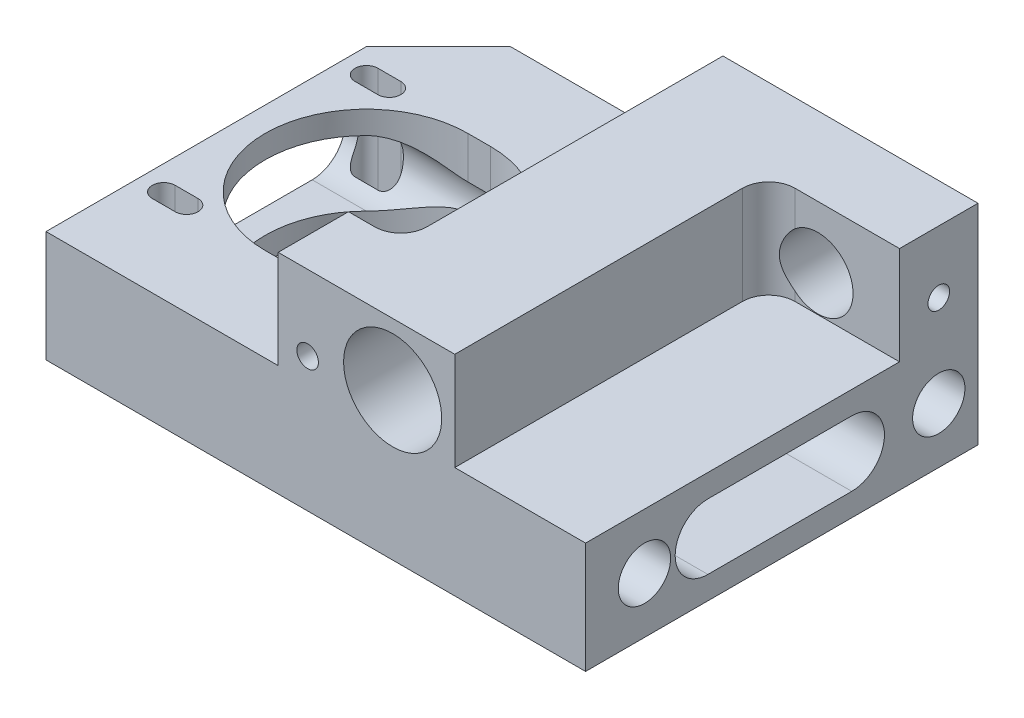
from build123d import *

# Parameters (mm, degrees)
BOSS_EXTRU_1_DEPTH             = 32
ENL_V_MAT_EXTRU_1_DEPTH        = 15
ESQUISSE3_R                    = 7.5
ENL_V_MAT_EXTRU_2_DEPTH        = 107.912347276
TROU_TARAUD_M12X1_251_D        = 10.8
TROU_TARAUD_M41_D              = 3.3
TROUS_DE_CENTRAGE_8_0MM1_D     = 8
TROUS_DE_CENTRAGE_8_0MM1_DEPTH = 39
TROUS_DE_CENTRAGE_8_0MM1_TIP   = 2.403442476
ENL_V_MAT_EXTRU_3_DEPTH        = 107.912347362
TROU_TARAUD_M42_D              = 3.3
TROU_TARAUD_M42_DEPTH          = 10
TROU_TARAUD_M42_TIP            = 0.991420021


with BuildPart() as part:
    # Esquisse1 → Boss.-Extru.1 (new body)
    with BuildSketch(Plane(origin=(0, 0, 0), x_dir=(1, 0, 0), z_dir=(0, 1, 0))):
        Polygon((0, 0), (0, 49), (11, 60), (82.5, 60), (82.5, 0), align=None)
        with BuildLine():
            Line((34.75, 47), (38.25, 47))
            ThreePointArc((38.25, 47), (40, 45.25), (38.25, 43.5))
            Line((38.25, 43.5), (34.75, 43.5))
            ThreePointArc((34.75, 43.5), (33, 45.25), (34.75, 47))
        make_face(mode=Mode.SUBTRACT)
        with BuildLine():
            Line((3.75, 47), (7.25, 47))
            ThreePointArc((7.25, 47), (9, 45.25), (7.25, 43.5))
            Line((7.25, 43.5), (3.75, 43.5))
            ThreePointArc((3.75, 43.5), (2, 45.25), (3.75, 47))
        make_face(mode=Mode.SUBTRACT)
        with BuildLine():
            Line((34.75, 16), (38.25, 16))
            ThreePointArc((38.25, 16), (40, 14.25), (38.25, 12.5))
            Line((38.25, 12.5), (34.75, 12.5))
            ThreePointArc((34.75, 12.5), (33, 14.25), (34.75, 16))
        make_face(mode=Mode.SUBTRACT)
        with BuildLine():
            Line((3.75, 16), (7.25, 16))
            ThreePointArc((7.25, 16), (9, 14.25), (7.25, 12.5))
            Line((7.25, 12.5), (3.75, 12.5))
            ThreePointArc((3.75, 12.5), (2, 14.25), (3.75, 16))
        make_face(mode=Mode.SUBTRACT)
        with BuildLine():
            Line((19.25, 45.25), (22.75, 45.25))
            ThreePointArc((22.75, 45.25), (38.25, 29.75), (22.75, 14.25))
            Line((22.75, 14.25), (19.25, 14.25))
            ThreePointArc((19.25, 14.25), (3.75, 29.75), (19.25, 45.25))
        make_face(mode=Mode.SUBTRACT)
    extrude(amount=BOSS_EXTRU_1_DEPTH)

    # Esquisse2 → Enl_v. mat.-Extru.1 (cut)
    with BuildSketch(Plane(origin=(0, 32, 0), x_dir=(1, 0, 0), z_dir=(0, 1, 0))):
        with BuildLine():
            Line((0, 49), (11, 60))
            Line((11, 60), (43.5, 60))
            Line((43.5, 60), (43.5, 14.75))
            ThreePointArc((43.5, 14.75), (42.328427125, 11.921572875), (39.5, 10.75))
            Line((39.5, 10.75), (35.5, 10.75))
            Line((35.5, 10.75), (35.5, 0))
            Line((35.5, 0), (0, 0))
            Line((0, 0), (0, 49))
        make_face()
        with BuildLine():
            Line((66.5, 48), (82.5, 48))
            Line((82.5, 48), (82.5, 0))
            Line((82.5, 0), (62.5, 0))
            Line((62.5, 0), (62.5, 44))
            ThreePointArc((62.5, 44), (63.671572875, 46.828427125), (66.5, 48))
        make_face()
    extrude(amount=-ENL_V_MAT_EXTRU_1_DEPTH, mode=Mode.SUBTRACT)

    # Esquisse3 → Enl_v. mat.-Extru.2 (cut, through all)
    with BuildSketch(Plane(origin=(0, 0, -60), x_dir=(-1, 0, 0), z_dir=(0, 0, -1))):
        with Locations((-53, 22.5)):
            Circle(ESQUISSE3_R)
    extrude(amount=-ENL_V_MAT_EXTRU_2_DEPTH, mode=Mode.SUBTRACT)

    # Trou taraud_ M12x1.251 (through all)
    with Locations(Plane(origin=(0, 0, -60), x_dir=(-1, 0, 0), z_dir=(0, 0, -1))):
        with Locations((-70, 22.5)):
            Hole(TROU_TARAUD_M12X1_251_D / 2)

    # Trou taraud_ M41 (through all)
    with Locations(Plane.XY):
        with Locations((40, 20.5)):
            Hole(TROU_TARAUD_M41_D / 2)

    # Trous de centrage _8.0mm1
    with Locations(Plane(origin=(82.5, 0, 0), x_dir=(0, 0, -1), z_dir=(1, 0, 0))):
        with Locations((9, 8.5), (54, 8.5)):
            Hole(TROUS_DE_CENTRAGE_8_0MM1_D / 2, depth=TROUS_DE_CENTRAGE_8_0MM1_DEPTH)
            with Locations((0, 0, -(TROUS_DE_CENTRAGE_8_0MM1_DEPTH + TROUS_DE_CENTRAGE_8_0MM1_TIP / 2))):  # 118° drill point
                Cone(0, TROUS_DE_CENTRAGE_8_0MM1_D / 2, TROUS_DE_CENTRAGE_8_0MM1_TIP, mode=Mode.SUBTRACT)

    # Esquisse10 → Enl_v. mat.-Extru.3 (cut, through all)
    with BuildSketch(Plane(origin=(82.5, 0, 0), x_dir=(0, 0, -1), z_dir=(1, 0, 0))):
        with BuildLine():
            Line((18.7, 13.5), (40.7, 13.5))
            ThreePointArc((40.7, 13.5), (45.7, 8.5), (40.7, 3.5))
            Line((40.7, 3.5), (18.7, 3.5))
            ThreePointArc((18.7, 3.5), (13.7, 8.5), (18.7, 13.5))
        make_face()
    extrude(amount=-ENL_V_MAT_EXTRU_3_DEPTH, mode=Mode.SUBTRACT)

    # Trou taraud_ M42
    with Locations(Plane(origin=(82.5, 0, 0), x_dir=(0, 0, -1), z_dir=(1, 0, 0))):
        with Locations((54, 22.5)):
            Hole(TROU_TARAUD_M42_D / 2, depth=TROU_TARAUD_M42_DEPTH)
            with Locations((0, 0, -(TROU_TARAUD_M42_DEPTH + TROU_TARAUD_M42_TIP / 2))):  # 118° drill point
                Cone(0, TROU_TARAUD_M42_D / 2, TROU_TARAUD_M42_TIP, mode=Mode.SUBTRACT)


solid = part.part
